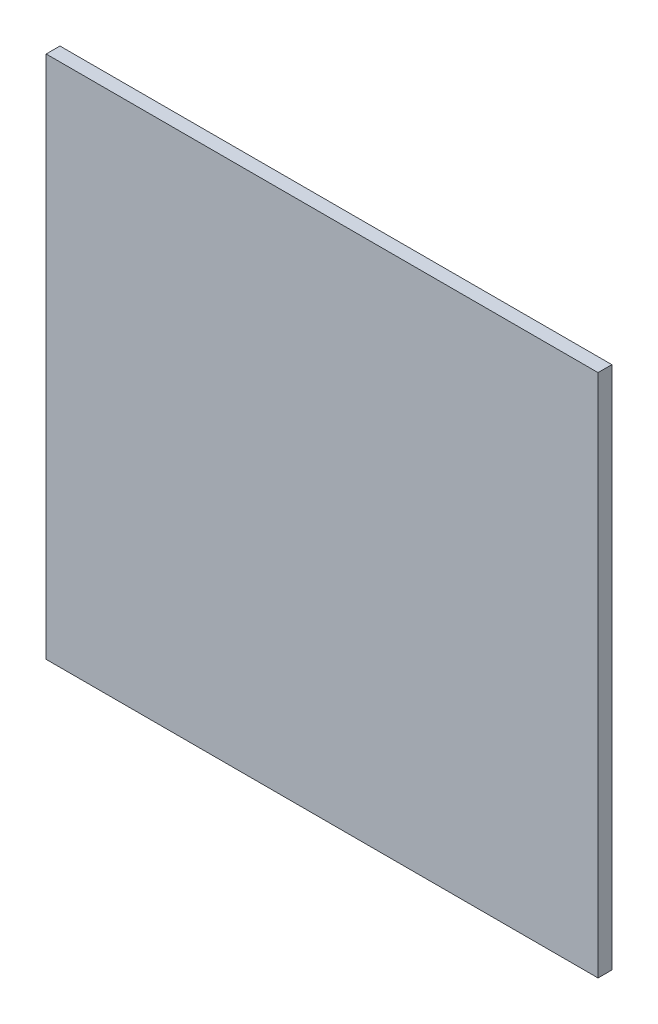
ISO-10303-21;
HEADER;
FILE_DESCRIPTION(('STEP AP214'),'2;1');
FILE_NAME('part.step','',(''),(''),'','','');
FILE_SCHEMA(('AUTOMOTIVE_DESIGN { 1 0 10303 214 1 1 1 1 }'));
ENDSEC;
DATA;
#1=APPLICATION_CONTEXT('core data for automotive mechanical design processes');
#2=APPLICATION_PROTOCOL_DEFINITION('international standard','automotive_design',2000,#1);
#3=PRODUCT_CONTEXT('',#1,'mechanical');
#4=PRODUCT('Part','Part','',(#3));
#5=PRODUCT_RELATED_PRODUCT_CATEGORY('part','',(#4));
#6=PRODUCT_DEFINITION_FORMATION('','',#4);
#7=PRODUCT_DEFINITION_CONTEXT('part definition',#1,'design');
#8=PRODUCT_DEFINITION('design','',#6,#7);
#9=PRODUCT_DEFINITION_SHAPE('','',#8);
#10=(LENGTH_UNIT() NAMED_UNIT(*) SI_UNIT(.MILLI.,.METRE.));
#11=(NAMED_UNIT(*) PLANE_ANGLE_UNIT() SI_UNIT($,.RADIAN.));
#12=(NAMED_UNIT(*) SI_UNIT($,.STERADIAN.) SOLID_ANGLE_UNIT());
#13=UNCERTAINTY_MEASURE_WITH_UNIT(LENGTH_MEASURE(1.E-05),#10,'distance_accuracy_value','');
#14=(GEOMETRIC_REPRESENTATION_CONTEXT(3) GLOBAL_UNCERTAINTY_ASSIGNED_CONTEXT((#13)) GLOBAL_UNIT_ASSIGNED_CONTEXT((#10,
#11,#12)) REPRESENTATION_CONTEXT('',''));
#15=CARTESIAN_POINT('',(0.,0.,0.));
#16=DIRECTION('',(0.,0.,1.));
#17=DIRECTION('',(1.,0.,0.));
#18=AXIS2_PLACEMENT_3D('',#15,#16,#17);
#19=CARTESIAN_POINT('',(300.,285.,15.));
#20=DIRECTION('',(-1.,0.,0.));
#21=DIRECTION('',(0.,-1.,0.));
#22=AXIS2_PLACEMENT_3D('',#19,#20,#21);
#23=PLANE('',#22);
#24=DIRECTION('',(0.,1.,0.));
#25=VECTOR('',#24,1.);
#26=CARTESIAN_POINT('',(300.,285.,0.));
#27=LINE('',#26,#25);
#28=CARTESIAN_POINT('',(300.,-285.,0.));
#29=VERTEX_POINT('',#28);
#30=CARTESIAN_POINT('',(300.,285.,0.));
#31=VERTEX_POINT('',#30);
#32=EDGE_CURVE('E111',#29,#31,#27,.T.);
#33=ORIENTED_EDGE('',*,*,#32,.T.);
#34=DIRECTION('',(0.,0.,-1.));
#35=VECTOR('',#34,1.);
#36=CARTESIAN_POINT('',(300.,285.,15.));
#37=LINE('',#36,#35);
#38=CARTESIAN_POINT('',(300.,285.,15.));
#39=VERTEX_POINT('',#38);
#40=EDGE_CURVE('E11',#39,#31,#37,.T.);
#41=ORIENTED_EDGE('',*,*,#40,.F.);
#42=DIRECTION('',(0.,1.,0.));
#43=VECTOR('',#42,1.);
#44=CARTESIAN_POINT('',(300.,285.,15.));
#45=LINE('',#44,#43);
#46=CARTESIAN_POINT('',(300.,-285.,15.));
#47=VERTEX_POINT('',#46);
#48=EDGE_CURVE('E95',#47,#39,#45,.T.);
#49=ORIENTED_EDGE('',*,*,#48,.F.);
#50=DIRECTION('',(0.,0.,-1.));
#51=VECTOR('',#50,1.);
#52=CARTESIAN_POINT('',(300.,-285.,15.));
#53=LINE('',#52,#51);
#54=EDGE_CURVE('E107',#47,#29,#53,.T.);
#55=ORIENTED_EDGE('',*,*,#54,.T.);
#56=EDGE_LOOP('',(#33,#41,#49,#55));
#57=FACE_BOUND('',#56,.T.);
#58=ADVANCED_FACE('F43',(#57),#23,.F.);
#59=CARTESIAN_POINT('',(-300.,285.,15.));
#60=DIRECTION('',(0.,-1.,0.));
#61=DIRECTION('',(0.,0.,-1.));
#62=AXIS2_PLACEMENT_3D('',#59,#60,#61);
#63=PLANE('',#62);
#64=DIRECTION('',(-1.,0.,0.));
#65=VECTOR('',#64,1.);
#66=CARTESIAN_POINT('',(-300.,285.,0.));
#67=LINE('',#66,#65);
#68=CARTESIAN_POINT('',(-300.,285.,0.));
#69=VERTEX_POINT('',#68);
#70=EDGE_CURVE('E100',#31,#69,#67,.T.);
#71=ORIENTED_EDGE('',*,*,#70,.T.);
#72=DIRECTION('',(0.,0.,-1.));
#73=VECTOR('',#72,1.);
#74=CARTESIAN_POINT('',(-300.,285.,15.));
#75=LINE('',#74,#73);
#76=CARTESIAN_POINT('',(-300.,285.,15.));
#77=VERTEX_POINT('',#76);
#78=EDGE_CURVE('E52',#77,#69,#75,.T.);
#79=ORIENTED_EDGE('',*,*,#78,.F.);
#80=DIRECTION('',(-1.,0.,0.));
#81=VECTOR('',#80,1.);
#82=CARTESIAN_POINT('',(-300.,285.,15.));
#83=LINE('',#82,#81);
#84=EDGE_CURVE('E90',#39,#77,#83,.T.);
#85=ORIENTED_EDGE('',*,*,#84,.F.);
#86=ORIENTED_EDGE('',*,*,#40,.T.);
#87=EDGE_LOOP('',(#71,#79,#85,#86));
#88=FACE_BOUND('',#87,.T.);
#89=ADVANCED_FACE('F99',(#88),#63,.F.);
#90=CARTESIAN_POINT('',(-300.,285.,15.));
#91=DIRECTION('',(1.,0.,0.));
#92=DIRECTION('',(0.,0.,-1.));
#93=AXIS2_PLACEMENT_3D('',#90,#91,#92);
#94=PLANE('',#93);
#95=DIRECTION('',(0.,-1.,0.));
#96=VECTOR('',#95,1.);
#97=CARTESIAN_POINT('',(-300.,285.,0.));
#98=LINE('',#97,#96);
#99=CARTESIAN_POINT('',(-300.,-285.,0.));
#100=VERTEX_POINT('',#99);
#101=EDGE_CURVE('E77',#69,#100,#98,.T.);
#102=ORIENTED_EDGE('',*,*,#101,.T.);
#103=DIRECTION('',(0.,0.,-1.));
#104=VECTOR('',#103,1.);
#105=CARTESIAN_POINT('',(-300.,-285.,15.));
#106=LINE('',#105,#104);
#107=CARTESIAN_POINT('',(-300.,-285.,15.));
#108=VERTEX_POINT('',#107);
#109=EDGE_CURVE('E102',#108,#100,#106,.T.);
#110=ORIENTED_EDGE('',*,*,#109,.F.);
#111=DIRECTION('',(0.,-1.,0.));
#112=VECTOR('',#111,1.);
#113=CARTESIAN_POINT('',(-300.,285.,15.));
#114=LINE('',#113,#112);
#115=EDGE_CURVE('E93',#77,#108,#114,.T.);
#116=ORIENTED_EDGE('',*,*,#115,.F.);
#117=ORIENTED_EDGE('',*,*,#78,.T.);
#118=EDGE_LOOP('',(#102,#110,#116,#117));
#119=FACE_BOUND('',#118,.T.);
#120=ADVANCED_FACE('F103',(#119),#94,.F.);
#121=CARTESIAN_POINT('',(-300.,-285.,15.));
#122=DIRECTION('',(0.,1.,0.));
#123=DIRECTION('',(0.,0.,1.));
#124=AXIS2_PLACEMENT_3D('',#121,#122,#123);
#125=PLANE('',#124);
#126=DIRECTION('',(1.,0.,0.));
#127=VECTOR('',#126,1.);
#128=CARTESIAN_POINT('',(-300.,-285.,0.));
#129=LINE('',#128,#127);
#130=EDGE_CURVE('E83',#100,#29,#129,.T.);
#131=ORIENTED_EDGE('',*,*,#130,.T.);
#132=ORIENTED_EDGE('',*,*,#54,.F.);
#133=DIRECTION('',(1.,0.,0.));
#134=VECTOR('',#133,1.);
#135=CARTESIAN_POINT('',(-300.,-285.,15.));
#136=LINE('',#135,#134);
#137=EDGE_CURVE('E60',#108,#47,#136,.T.);
#138=ORIENTED_EDGE('',*,*,#137,.F.);
#139=ORIENTED_EDGE('',*,*,#109,.T.);
#140=EDGE_LOOP('',(#131,#132,#138,#139));
#141=FACE_BOUND('',#140,.T.);
#142=ADVANCED_FACE('F124',(#141),#125,.F.);
#143=CARTESIAN_POINT('',(0.,0.,15.));
#144=DIRECTION('',(0.,0.,1.));
#145=DIRECTION('',(1.,0.,0.));
#146=AXIS2_PLACEMENT_3D('',#143,#144,#145);
#147=PLANE('',#146);
#148=ORIENTED_EDGE('',*,*,#48,.T.);
#149=ORIENTED_EDGE('',*,*,#84,.T.);
#150=ORIENTED_EDGE('',*,*,#115,.T.);
#151=ORIENTED_EDGE('',*,*,#137,.T.);
#152=EDGE_LOOP('',(#148,#149,#150,#151));
#153=FACE_BOUND('',#152,.T.);
#154=ADVANCED_FACE('F91',(#153),#147,.T.);
#155=CARTESIAN_POINT('',(0.,0.,0.));
#156=DIRECTION('',(0.,0.,1.));
#157=DIRECTION('',(1.,0.,0.));
#158=AXIS2_PLACEMENT_3D('',#155,#156,#157);
#159=PLANE('',#158);
#160=ORIENTED_EDGE('',*,*,#32,.F.);
#161=ORIENTED_EDGE('',*,*,#130,.F.);
#162=ORIENTED_EDGE('',*,*,#101,.F.);
#163=ORIENTED_EDGE('',*,*,#70,.F.);
#164=EDGE_LOOP('',(#160,#161,#162,#163));
#165=FACE_BOUND('',#164,.T.);
#166=ADVANCED_FACE('F127',(#165),#159,.F.);
#167=CLOSED_SHELL('',(#58,#89,#120,#142,#154,#166));
#168=MANIFOLD_SOLID_BREP('B2',#167);
#169=ADVANCED_BREP_SHAPE_REPRESENTATION('',(#18,#168),#14);
#170=SHAPE_DEFINITION_REPRESENTATION(#9,#169);
ENDSEC;
END-ISO-10303-21;
